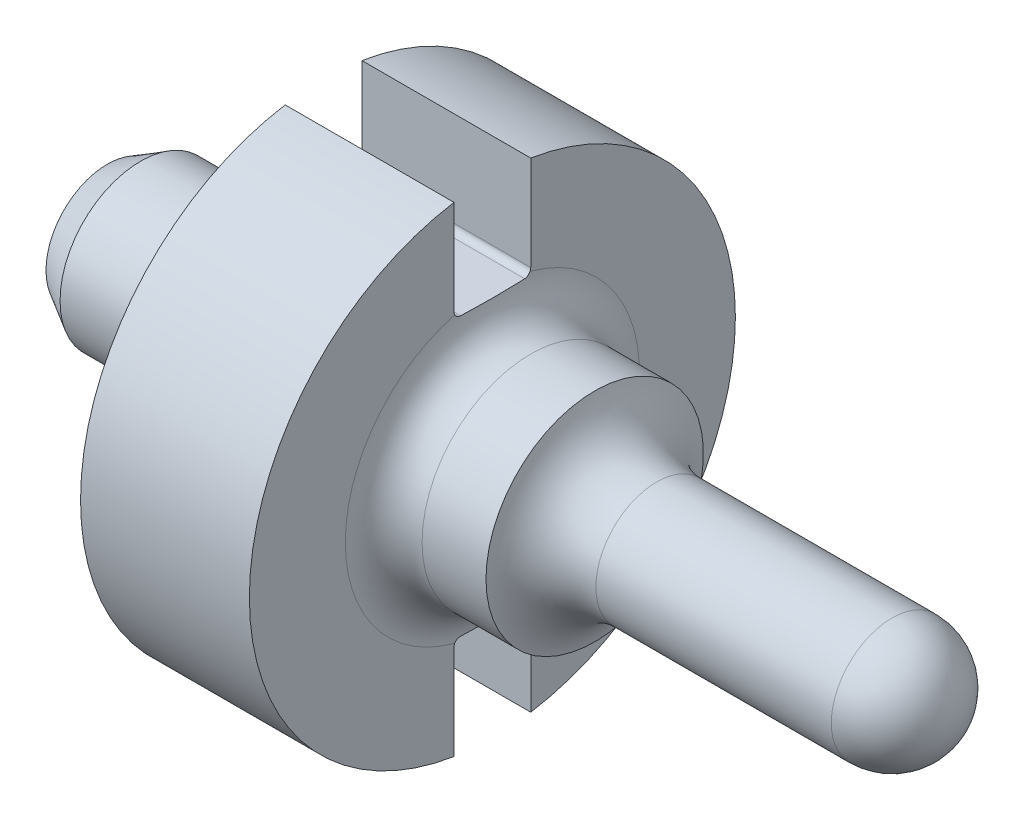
from build123d import *

# Parameters (mm, degrees)
CUT_EXTRUDE1_REACH = 16.239


with BuildPart() as part:
    # Sketch1 → Revolve1 (revolve)
    with BuildSketch(Plane.XY, mode=Mode.PRIVATE) as revolve1_sk:
        with BuildLine():
            Line((0, 0), (0, 1.2192))
            Line((0, 1.2192), (0.659911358, 1.6002))
            Line((0.659911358, 1.6002), (3.5306, 1.6002))
            ThreePointArc((3.5306, 1.6002), (4.069415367, 1.823384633), (4.2926, 2.3622))
            Line((4.2926, 2.3622), (4.2926, 4.826))
            Line((4.2926, 4.826), (7.6454, 4.826))
            Line((7.6454, 4.826), (7.6454, 2.921))
            ThreePointArc((7.6454, 2.921), (7.868584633, 2.382184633), (8.4074, 2.159))
            Line((8.4074, 2.159), (9.6774, 2.159))
            ThreePointArc((9.6774, 2.159), (10.129359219, 1.472476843), (10.907072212, 1.2065))
            Line((10.907072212, 1.2065), (15.5829, 1.2065))
            ThreePointArc((15.5829, 1.2065), (16.436024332, 0.853124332), (16.7894, 0))
            Line((16.7894, 0), (0, 0))
        make_face()
    revolve(revolve1_sk.sketch.rotate(Axis((0, 0, 0), (1, 0, 0)), 90), axis=Axis((0, 0, 0), (1, 0, 0)))

    # Sketch2 → Cut-Extrude1 (cut, up to next)
    with BuildSketch(Plane.ZY.offset(-4.2926), mode=Mode.PRIVATE) as cut_extrude1_sk1:
        with BuildLine():
            Line((-0.635, 2.7559), (0.635, 2.7559))
            ThreePointArc((0.635, 2.7559), (0.724802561, 2.793097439), (0.762, 2.8829))
            Line((0.762, 2.8829), (0.762, 6.8961))
            Line((0.762, 6.8961), (-0.762, 6.8961))
            Line((-0.762, 6.8961), (-0.762, 2.8829))
            ThreePointArc((-0.762, 2.8829), (-0.724802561, 2.793097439), (-0.635, 2.7559))
        make_face()
    cut_extrude1_tool1 = extrude(cut_extrude1_sk1.sketch, amount=-CUT_EXTRUDE1_REACH, mode=Mode.PRIVATE) & part.part
    # Sketch2 → Cut-Extrude1 (cut, up to next)
    with BuildSketch(Plane.ZY.offset(-4.2926), mode=Mode.PRIVATE) as cut_extrude1_sk2:
        with BuildLine():
            Line((0.762, -2.8829), (0.762, -6.8961))
            Line((0.762, -6.8961), (-0.762, -6.8961))
            Line((-0.762, -6.8961), (-0.762, -2.8829))
            ThreePointArc((-0.762, -2.8829), (-0.724802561, -2.793097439), (-0.635, -2.7559))
            Line((-0.635, -2.7559), (0.635, -2.7559))
            ThreePointArc((0.635, -2.7559), (0.724802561, -2.793097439), (0.762, -2.8829))
        make_face()
    cut_extrude1_tool2 = extrude(cut_extrude1_sk2.sketch, amount=-CUT_EXTRUDE1_REACH, mode=Mode.PRIVATE) & part.part
    add(cut_extrude1_tool1.solids().sort_by_distance((4.2926, 4.828243, 0))[0], mode=Mode.SUBTRACT)
    add(cut_extrude1_tool2.solids().sort_by_distance((4.2926, -4.828243, 0))[0], mode=Mode.SUBTRACT)


solid = part.part
